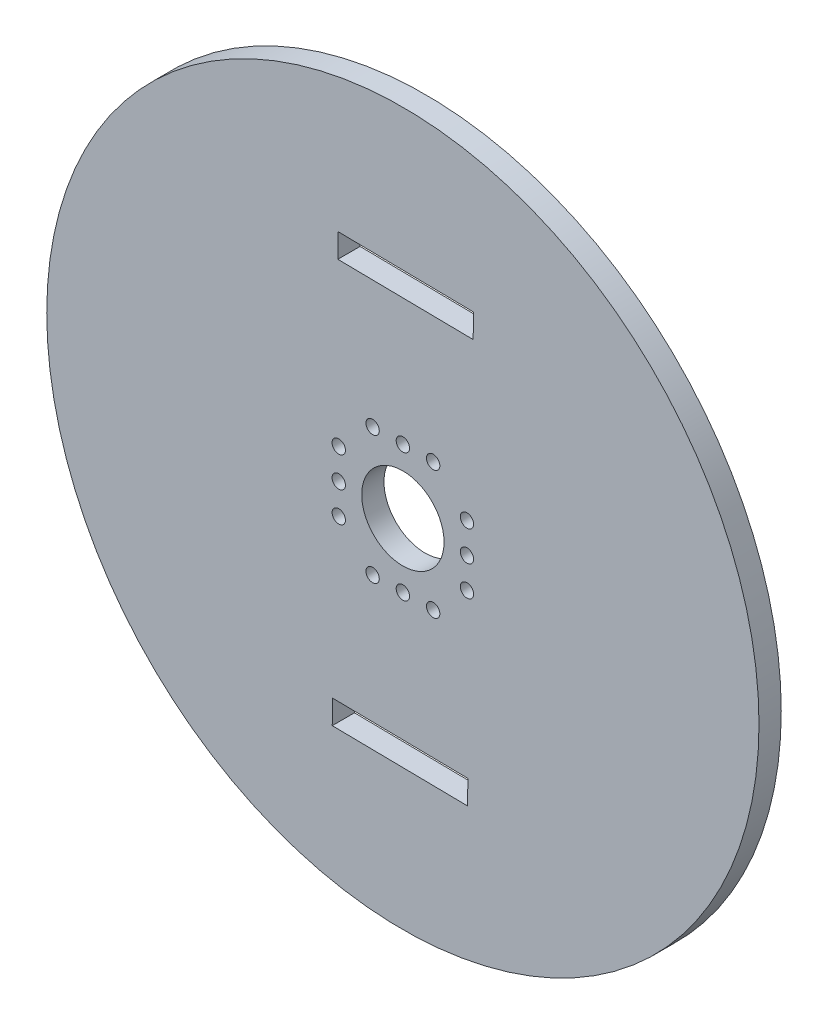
ISO-10303-21;
HEADER;
FILE_DESCRIPTION(('STEP AP214'),'2;1');
FILE_NAME('part.step','',(''),(''),'','','');
FILE_SCHEMA(('AUTOMOTIVE_DESIGN { 1 0 10303 214 1 1 1 1 }'));
ENDSEC;
DATA;
#1=APPLICATION_CONTEXT('core data for automotive mechanical design processes');
#2=APPLICATION_PROTOCOL_DEFINITION('international standard','automotive_design',2000,#1);
#3=PRODUCT_CONTEXT('',#1,'mechanical');
#4=PRODUCT('Part','Part','',(#3));
#5=PRODUCT_RELATED_PRODUCT_CATEGORY('part','',(#4));
#6=PRODUCT_DEFINITION_FORMATION('','',#4);
#7=PRODUCT_DEFINITION_CONTEXT('part definition',#1,'design');
#8=PRODUCT_DEFINITION('design','',#6,#7);
#9=PRODUCT_DEFINITION_SHAPE('','',#8);
#10=(LENGTH_UNIT() NAMED_UNIT(*) SI_UNIT(.MILLI.,.METRE.));
#11=(NAMED_UNIT(*) PLANE_ANGLE_UNIT() SI_UNIT($,.RADIAN.));
#12=(NAMED_UNIT(*) SI_UNIT($,.STERADIAN.) SOLID_ANGLE_UNIT());
#13=UNCERTAINTY_MEASURE_WITH_UNIT(LENGTH_MEASURE(1.E-05),#10,'distance_accuracy_value','');
#14=(GEOMETRIC_REPRESENTATION_CONTEXT(3) GLOBAL_UNCERTAINTY_ASSIGNED_CONTEXT((#13)) GLOBAL_UNIT_ASSIGNED_CONTEXT((#10,
#11,#12)) REPRESENTATION_CONTEXT('',''));
#15=CARTESIAN_POINT('',(0.,0.,0.));
#16=DIRECTION('',(0.,0.,1.));
#17=DIRECTION('',(1.,0.,0.));
#18=AXIS2_PLACEMENT_3D('',#15,#16,#17);
#19=CARTESIAN_POINT('',(3.39999999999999,7.19999999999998,2.5));
#20=DIRECTION('',(0.,0.,-1.));
#21=DIRECTION('',(-1.,0.,0.));
#22=AXIS2_PLACEMENT_3D('',#19,#20,#21);
#23=CYLINDRICAL_SURFACE('',#22,0.750000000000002);
#24=CARTESIAN_POINT('',(3.39999999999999,7.19999999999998,2.5));
#25=DIRECTION('',(0.,0.,1.));
#26=DIRECTION('',(1.,0.,0.));
#27=AXIS2_PLACEMENT_3D('',#24,#25,#26);
#28=CIRCLE('',#27,0.750000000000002);
#29=CARTESIAN_POINT('',(4.14999999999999,7.19999999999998,2.5));
#30=VERTEX_POINT('',#29);
#31=EDGE_CURVE('E48',#30,#30,#28,.T.);
#32=ORIENTED_EDGE('',*,*,#31,.T.);
#33=EDGE_LOOP('',(#32));
#34=FACE_BOUND('',#33,.T.);
#35=CARTESIAN_POINT('',(3.39999999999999,7.19999999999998,0.));
#36=DIRECTION('',(0.,0.,1.));
#37=DIRECTION('',(1.,0.,0.));
#38=AXIS2_PLACEMENT_3D('',#35,#36,#37);
#39=CIRCLE('',#38,0.750000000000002);
#40=CARTESIAN_POINT('',(4.14999999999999,7.19999999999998,0.));
#41=VERTEX_POINT('',#40);
#42=EDGE_CURVE('E243',#41,#41,#39,.T.);
#43=ORIENTED_EDGE('',*,*,#42,.F.);
#44=EDGE_LOOP('',(#43));
#45=FACE_BOUND('',#44,.T.);
#46=ADVANCED_FACE('F39',(#34,#45),#23,.F.);
#47=CARTESIAN_POINT('',(0.,7.19999999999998,2.5));
#48=DIRECTION('',(0.,0.,-1.));
#49=DIRECTION('',(-1.,0.,0.));
#50=AXIS2_PLACEMENT_3D('',#47,#48,#49);
#51=CYLINDRICAL_SURFACE('',#50,0.750000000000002);
#52=CARTESIAN_POINT('',(0.,7.19999999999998,2.5));
#53=DIRECTION('',(0.,0.,1.));
#54=DIRECTION('',(1.,0.,0.));
#55=AXIS2_PLACEMENT_3D('',#52,#53,#54);
#56=CIRCLE('',#55,0.750000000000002);
#57=CARTESIAN_POINT('',(0.749999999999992,7.19999999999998,2.5));
#58=VERTEX_POINT('',#57);
#59=EDGE_CURVE('E204',#58,#58,#56,.T.);
#60=ORIENTED_EDGE('',*,*,#59,.T.);
#61=EDGE_LOOP('',(#60));
#62=FACE_BOUND('',#61,.T.);
#63=CARTESIAN_POINT('',(0.,7.19999999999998,0.));
#64=DIRECTION('',(0.,0.,1.));
#65=DIRECTION('',(1.,0.,0.));
#66=AXIS2_PLACEMENT_3D('',#63,#64,#65);
#67=CIRCLE('',#66,0.750000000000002);
#68=CARTESIAN_POINT('',(0.749999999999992,7.19999999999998,0.));
#69=VERTEX_POINT('',#68);
#70=EDGE_CURVE('E241',#69,#69,#67,.T.);
#71=ORIENTED_EDGE('',*,*,#70,.F.);
#72=EDGE_LOOP('',(#71));
#73=FACE_BOUND('',#72,.T.);
#74=ADVANCED_FACE('F267',(#62,#73),#51,.F.);
#75=CARTESIAN_POINT('',(-3.40000000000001,7.19999999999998,2.5));
#76=DIRECTION('',(0.,0.,-1.));
#77=DIRECTION('',(-1.,0.,0.));
#78=AXIS2_PLACEMENT_3D('',#75,#76,#77);
#79=CYLINDRICAL_SURFACE('',#78,0.750000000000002);
#80=CARTESIAN_POINT('',(-3.40000000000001,7.19999999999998,2.5));
#81=DIRECTION('',(0.,0.,1.));
#82=DIRECTION('',(1.,0.,0.));
#83=AXIS2_PLACEMENT_3D('',#80,#81,#82);
#84=CIRCLE('',#83,0.750000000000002);
#85=CARTESIAN_POINT('',(-2.65000000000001,7.19999999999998,2.5));
#86=VERTEX_POINT('',#85);
#87=EDGE_CURVE('E201',#86,#86,#84,.T.);
#88=ORIENTED_EDGE('',*,*,#87,.T.);
#89=EDGE_LOOP('',(#88));
#90=FACE_BOUND('',#89,.T.);
#91=CARTESIAN_POINT('',(-3.40000000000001,7.19999999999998,0.));
#92=DIRECTION('',(0.,0.,1.));
#93=DIRECTION('',(1.,0.,0.));
#94=AXIS2_PLACEMENT_3D('',#91,#92,#93);
#95=CIRCLE('',#94,0.750000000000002);
#96=CARTESIAN_POINT('',(-2.65000000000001,7.19999999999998,0.));
#97=VERTEX_POINT('',#96);
#98=EDGE_CURVE('E238',#97,#97,#95,.T.);
#99=ORIENTED_EDGE('',*,*,#98,.F.);
#100=EDGE_LOOP('',(#99));
#101=FACE_BOUND('',#100,.T.);
#102=ADVANCED_FACE('F272',(#90,#101),#79,.F.);
#103=CARTESIAN_POINT('',(-7.20000000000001,3.39999999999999,2.5));
#104=DIRECTION('',(0.,0.,-1.));
#105=DIRECTION('',(-1.,0.,0.));
#106=AXIS2_PLACEMENT_3D('',#103,#104,#105);
#107=CYLINDRICAL_SURFACE('',#106,0.75);
#108=CARTESIAN_POINT('',(-7.20000000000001,3.39999999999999,2.5));
#109=DIRECTION('',(0.,0.,1.));
#110=DIRECTION('',(1.,0.,0.));
#111=AXIS2_PLACEMENT_3D('',#108,#109,#110);
#112=CIRCLE('',#111,0.75);
#113=CARTESIAN_POINT('',(-6.45000000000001,3.39999999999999,2.5));
#114=VERTEX_POINT('',#113);
#115=EDGE_CURVE('E198',#114,#114,#112,.T.);
#116=ORIENTED_EDGE('',*,*,#115,.T.);
#117=EDGE_LOOP('',(#116));
#118=FACE_BOUND('',#117,.T.);
#119=CARTESIAN_POINT('',(-7.20000000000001,3.39999999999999,0.));
#120=DIRECTION('',(0.,0.,1.));
#121=DIRECTION('',(1.,0.,0.));
#122=AXIS2_PLACEMENT_3D('',#119,#120,#121);
#123=CIRCLE('',#122,0.75);
#124=CARTESIAN_POINT('',(-6.45000000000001,3.39999999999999,0.));
#125=VERTEX_POINT('',#124);
#126=EDGE_CURVE('E235',#125,#125,#123,.T.);
#127=ORIENTED_EDGE('',*,*,#126,.F.);
#128=EDGE_LOOP('',(#127));
#129=FACE_BOUND('',#128,.T.);
#130=ADVANCED_FACE('F279',(#118,#129),#107,.F.);
#131=CARTESIAN_POINT('',(-7.20000000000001,0.,2.5));
#132=DIRECTION('',(0.,0.,-1.));
#133=DIRECTION('',(-1.,0.,0.));
#134=AXIS2_PLACEMENT_3D('',#131,#132,#133);
#135=CYLINDRICAL_SURFACE('',#134,0.75);
#136=CARTESIAN_POINT('',(-7.20000000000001,0.,2.5));
#137=DIRECTION('',(0.,0.,1.));
#138=DIRECTION('',(1.,0.,0.));
#139=AXIS2_PLACEMENT_3D('',#136,#137,#138);
#140=CIRCLE('',#139,0.75);
#141=CARTESIAN_POINT('',(-6.45000000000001,0.,2.5));
#142=VERTEX_POINT('',#141);
#143=EDGE_CURVE('E195',#142,#142,#140,.T.);
#144=ORIENTED_EDGE('',*,*,#143,.T.);
#145=EDGE_LOOP('',(#144));
#146=FACE_BOUND('',#145,.T.);
#147=CARTESIAN_POINT('',(-7.20000000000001,0.,0.));
#148=DIRECTION('',(0.,0.,1.));
#149=DIRECTION('',(1.,0.,0.));
#150=AXIS2_PLACEMENT_3D('',#147,#148,#149);
#151=CIRCLE('',#150,0.75);
#152=CARTESIAN_POINT('',(-6.45000000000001,0.,0.));
#153=VERTEX_POINT('',#152);
#154=EDGE_CURVE('E232',#153,#153,#151,.T.);
#155=ORIENTED_EDGE('',*,*,#154,.F.);
#156=EDGE_LOOP('',(#155));
#157=FACE_BOUND('',#156,.T.);
#158=ADVANCED_FACE('F283',(#146,#157),#135,.F.);
#159=CARTESIAN_POINT('',(-7.20000000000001,-3.40000000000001,2.5));
#160=DIRECTION('',(0.,0.,-1.));
#161=DIRECTION('',(-1.,0.,0.));
#162=AXIS2_PLACEMENT_3D('',#159,#160,#161);
#163=CYLINDRICAL_SURFACE('',#162,0.750000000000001);
#164=CARTESIAN_POINT('',(-7.20000000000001,-3.40000000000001,2.5));
#165=DIRECTION('',(0.,0.,1.));
#166=DIRECTION('',(1.,0.,0.));
#167=AXIS2_PLACEMENT_3D('',#164,#165,#166);
#168=CIRCLE('',#167,0.750000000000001);
#169=CARTESIAN_POINT('',(-6.45000000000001,-3.40000000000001,2.5));
#170=VERTEX_POINT('',#169);
#171=EDGE_CURVE('E192',#170,#170,#168,.T.);
#172=ORIENTED_EDGE('',*,*,#171,.T.);
#173=EDGE_LOOP('',(#172));
#174=FACE_BOUND('',#173,.T.);
#175=CARTESIAN_POINT('',(-7.20000000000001,-3.40000000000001,0.));
#176=DIRECTION('',(0.,0.,1.));
#177=DIRECTION('',(1.,0.,0.));
#178=AXIS2_PLACEMENT_3D('',#175,#176,#177);
#179=CIRCLE('',#178,0.750000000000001);
#180=CARTESIAN_POINT('',(-6.45000000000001,-3.40000000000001,0.));
#181=VERTEX_POINT('',#180);
#182=EDGE_CURVE('E229',#181,#181,#179,.T.);
#183=ORIENTED_EDGE('',*,*,#182,.F.);
#184=EDGE_LOOP('',(#183));
#185=FACE_BOUND('',#184,.T.);
#186=ADVANCED_FACE('F287',(#174,#185),#163,.F.);
#187=CARTESIAN_POINT('',(0.,-7.20000000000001,2.5));
#188=DIRECTION('',(0.,0.,-1.));
#189=DIRECTION('',(-1.,0.,0.));
#190=AXIS2_PLACEMENT_3D('',#187,#188,#189);
#191=CYLINDRICAL_SURFACE('',#190,0.75);
#192=CARTESIAN_POINT('',(0.,-7.20000000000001,2.5));
#193=DIRECTION('',(0.,0.,1.));
#194=DIRECTION('',(1.,0.,0.));
#195=AXIS2_PLACEMENT_3D('',#192,#193,#194);
#196=CIRCLE('',#195,0.75);
#197=CARTESIAN_POINT('',(0.749999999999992,-7.20000000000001,2.5));
#198=VERTEX_POINT('',#197);
#199=EDGE_CURVE('E189',#198,#198,#196,.T.);
#200=ORIENTED_EDGE('',*,*,#199,.T.);
#201=EDGE_LOOP('',(#200));
#202=FACE_BOUND('',#201,.T.);
#203=CARTESIAN_POINT('',(0.,-7.20000000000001,0.));
#204=DIRECTION('',(0.,0.,1.));
#205=DIRECTION('',(1.,0.,0.));
#206=AXIS2_PLACEMENT_3D('',#203,#204,#205);
#207=CIRCLE('',#206,0.75);
#208=CARTESIAN_POINT('',(0.749999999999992,-7.20000000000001,0.));
#209=VERTEX_POINT('',#208);
#210=EDGE_CURVE('E226',#209,#209,#207,.T.);
#211=ORIENTED_EDGE('',*,*,#210,.F.);
#212=EDGE_LOOP('',(#211));
#213=FACE_BOUND('',#212,.T.);
#214=ADVANCED_FACE('F291',(#202,#213),#191,.F.);
#215=CARTESIAN_POINT('',(-3.40000000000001,-7.20000000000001,2.5));
#216=DIRECTION('',(0.,0.,-1.));
#217=DIRECTION('',(-1.,0.,0.));
#218=AXIS2_PLACEMENT_3D('',#215,#216,#217);
#219=CYLINDRICAL_SURFACE('',#218,0.749999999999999);
#220=CARTESIAN_POINT('',(-3.40000000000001,-7.20000000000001,2.5));
#221=DIRECTION('',(0.,0.,1.));
#222=DIRECTION('',(1.,0.,0.));
#223=AXIS2_PLACEMENT_3D('',#220,#221,#222);
#224=CIRCLE('',#223,0.749999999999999);
#225=CARTESIAN_POINT('',(-2.65000000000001,-7.20000000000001,2.5));
#226=VERTEX_POINT('',#225);
#227=EDGE_CURVE('E186',#226,#226,#224,.T.);
#228=ORIENTED_EDGE('',*,*,#227,.T.);
#229=EDGE_LOOP('',(#228));
#230=FACE_BOUND('',#229,.T.);
#231=CARTESIAN_POINT('',(-3.40000000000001,-7.20000000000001,0.));
#232=DIRECTION('',(0.,0.,1.));
#233=DIRECTION('',(1.,0.,0.));
#234=AXIS2_PLACEMENT_3D('',#231,#232,#233);
#235=CIRCLE('',#234,0.749999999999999);
#236=CARTESIAN_POINT('',(-2.65000000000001,-7.20000000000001,0.));
#237=VERTEX_POINT('',#236);
#238=EDGE_CURVE('E223',#237,#237,#235,.T.);
#239=ORIENTED_EDGE('',*,*,#238,.F.);
#240=EDGE_LOOP('',(#239));
#241=FACE_BOUND('',#240,.T.);
#242=ADVANCED_FACE('F295',(#230,#241),#219,.F.);
#243=CARTESIAN_POINT('',(3.39999999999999,-7.20000000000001,2.5));
#244=DIRECTION('',(0.,0.,-1.));
#245=DIRECTION('',(-1.,0.,0.));
#246=AXIS2_PLACEMENT_3D('',#243,#244,#245);
#247=CYLINDRICAL_SURFACE('',#246,0.750000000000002);
#248=CARTESIAN_POINT('',(3.39999999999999,-7.20000000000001,2.5));
#249=DIRECTION('',(0.,0.,1.));
#250=DIRECTION('',(1.,0.,0.));
#251=AXIS2_PLACEMENT_3D('',#248,#249,#250);
#252=CIRCLE('',#251,0.750000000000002);
#253=CARTESIAN_POINT('',(4.14999999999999,-7.20000000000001,2.5));
#254=VERTEX_POINT('',#253);
#255=EDGE_CURVE('E183',#254,#254,#252,.T.);
#256=ORIENTED_EDGE('',*,*,#255,.T.);
#257=EDGE_LOOP('',(#256));
#258=FACE_BOUND('',#257,.T.);
#259=CARTESIAN_POINT('',(3.39999999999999,-7.20000000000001,0.));
#260=DIRECTION('',(0.,0.,1.));
#261=DIRECTION('',(1.,0.,0.));
#262=AXIS2_PLACEMENT_3D('',#259,#260,#261);
#263=CIRCLE('',#262,0.750000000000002);
#264=CARTESIAN_POINT('',(4.14999999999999,-7.20000000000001,0.));
#265=VERTEX_POINT('',#264);
#266=EDGE_CURVE('E220',#265,#265,#263,.T.);
#267=ORIENTED_EDGE('',*,*,#266,.F.);
#268=EDGE_LOOP('',(#267));
#269=FACE_BOUND('',#268,.T.);
#270=ADVANCED_FACE('F299',(#258,#269),#247,.F.);
#271=CARTESIAN_POINT('',(7.19999999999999,0.,2.5));
#272=DIRECTION('',(0.,0.,-1.));
#273=DIRECTION('',(-1.,0.,0.));
#274=AXIS2_PLACEMENT_3D('',#271,#272,#273);
#275=CYLINDRICAL_SURFACE('',#274,0.750000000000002);
#276=CARTESIAN_POINT('',(7.19999999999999,0.,2.5));
#277=DIRECTION('',(0.,0.,1.));
#278=DIRECTION('',(1.,0.,0.));
#279=AXIS2_PLACEMENT_3D('',#276,#277,#278);
#280=CIRCLE('',#279,0.750000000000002);
#281=CARTESIAN_POINT('',(7.94999999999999,0.,2.5));
#282=VERTEX_POINT('',#281);
#283=EDGE_CURVE('E180',#282,#282,#280,.T.);
#284=ORIENTED_EDGE('',*,*,#283,.T.);
#285=EDGE_LOOP('',(#284));
#286=FACE_BOUND('',#285,.T.);
#287=CARTESIAN_POINT('',(7.19999999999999,0.,0.));
#288=DIRECTION('',(0.,0.,1.));
#289=DIRECTION('',(1.,0.,0.));
#290=AXIS2_PLACEMENT_3D('',#287,#288,#289);
#291=CIRCLE('',#290,0.750000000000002);
#292=CARTESIAN_POINT('',(7.94999999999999,0.,0.));
#293=VERTEX_POINT('',#292);
#294=EDGE_CURVE('E217',#293,#293,#291,.T.);
#295=ORIENTED_EDGE('',*,*,#294,.F.);
#296=EDGE_LOOP('',(#295));
#297=FACE_BOUND('',#296,.T.);
#298=ADVANCED_FACE('F303',(#286,#297),#275,.F.);
#299=CARTESIAN_POINT('',(7.19999999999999,3.39999999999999,2.5));
#300=DIRECTION('',(0.,0.,-1.));
#301=DIRECTION('',(-1.,0.,0.));
#302=AXIS2_PLACEMENT_3D('',#299,#300,#301);
#303=CYLINDRICAL_SURFACE('',#302,0.750000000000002);
#304=CARTESIAN_POINT('',(7.19999999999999,3.39999999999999,2.5));
#305=DIRECTION('',(0.,0.,1.));
#306=DIRECTION('',(1.,0.,0.));
#307=AXIS2_PLACEMENT_3D('',#304,#305,#306);
#308=CIRCLE('',#307,0.750000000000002);
#309=CARTESIAN_POINT('',(7.94999999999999,3.39999999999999,2.5));
#310=VERTEX_POINT('',#309);
#311=EDGE_CURVE('E177',#310,#310,#308,.T.);
#312=ORIENTED_EDGE('',*,*,#311,.T.);
#313=EDGE_LOOP('',(#312));
#314=FACE_BOUND('',#313,.T.);
#315=CARTESIAN_POINT('',(7.19999999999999,3.39999999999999,0.));
#316=DIRECTION('',(0.,0.,1.));
#317=DIRECTION('',(1.,0.,0.));
#318=AXIS2_PLACEMENT_3D('',#315,#316,#317);
#319=CIRCLE('',#318,0.750000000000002);
#320=CARTESIAN_POINT('',(7.94999999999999,3.39999999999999,0.));
#321=VERTEX_POINT('',#320);
#322=EDGE_CURVE('E214',#321,#321,#319,.T.);
#323=ORIENTED_EDGE('',*,*,#322,.F.);
#324=EDGE_LOOP('',(#323));
#325=FACE_BOUND('',#324,.T.);
#326=ADVANCED_FACE('F307',(#314,#325),#303,.F.);
#327=CARTESIAN_POINT('',(7.19999999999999,-3.40000000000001,2.5));
#328=DIRECTION('',(0.,0.,-1.));
#329=DIRECTION('',(-1.,0.,0.));
#330=AXIS2_PLACEMENT_3D('',#327,#328,#329);
#331=CYLINDRICAL_SURFACE('',#330,0.750000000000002);
#332=CARTESIAN_POINT('',(7.19999999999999,-3.40000000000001,2.5));
#333=DIRECTION('',(0.,0.,1.));
#334=DIRECTION('',(1.,0.,0.));
#335=AXIS2_PLACEMENT_3D('',#332,#333,#334);
#336=CIRCLE('',#335,0.750000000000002);
#337=CARTESIAN_POINT('',(7.94999999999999,-3.40000000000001,2.5));
#338=VERTEX_POINT('',#337);
#339=EDGE_CURVE('E174',#338,#338,#336,.T.);
#340=ORIENTED_EDGE('',*,*,#339,.T.);
#341=EDGE_LOOP('',(#340));
#342=FACE_BOUND('',#341,.T.);
#343=CARTESIAN_POINT('',(7.19999999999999,-3.40000000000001,0.));
#344=DIRECTION('',(0.,0.,1.));
#345=DIRECTION('',(1.,0.,0.));
#346=AXIS2_PLACEMENT_3D('',#343,#344,#345);
#347=CIRCLE('',#346,0.750000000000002);
#348=CARTESIAN_POINT('',(7.94999999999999,-3.40000000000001,0.));
#349=VERTEX_POINT('',#348);
#350=EDGE_CURVE('E211',#349,#349,#347,.T.);
#351=ORIENTED_EDGE('',*,*,#350,.F.);
#352=EDGE_LOOP('',(#351));
#353=FACE_BOUND('',#352,.T.);
#354=ADVANCED_FACE('F262',(#342,#353),#331,.F.);
#355=CARTESIAN_POINT('',(0.,0.,2.5));
#356=DIRECTION('',(0.,0.,-1.));
#357=DIRECTION('',(-1.,0.,0.));
#358=AXIS2_PLACEMENT_3D('',#355,#356,#357);
#359=CYLINDRICAL_SURFACE('',#358,40.);
#360=CARTESIAN_POINT('',(0.,0.,2.5));
#361=DIRECTION('',(0.,0.,1.));
#362=DIRECTION('',(1.,0.,0.));
#363=AXIS2_PLACEMENT_3D('',#360,#361,#362);
#364=CIRCLE('',#363,40.);
#365=CARTESIAN_POINT('',(40.,0.,2.5));
#366=VERTEX_POINT('',#365);
#367=EDGE_CURVE('E171',#366,#366,#364,.T.);
#368=ORIENTED_EDGE('',*,*,#367,.F.);
#369=EDGE_LOOP('',(#368));
#370=FACE_BOUND('',#369,.T.);
#371=CARTESIAN_POINT('',(0.,0.,0.));
#372=DIRECTION('',(0.,0.,1.));
#373=DIRECTION('',(1.,0.,0.));
#374=AXIS2_PLACEMENT_3D('',#371,#372,#373);
#375=CIRCLE('',#374,40.);
#376=CARTESIAN_POINT('',(40.,0.,0.));
#377=VERTEX_POINT('',#376);
#378=EDGE_CURVE('E170',#377,#377,#375,.T.);
#379=ORIENTED_EDGE('',*,*,#378,.T.);
#380=EDGE_LOOP('',(#379));
#381=FACE_BOUND('',#380,.T.);
#382=ADVANCED_FACE('F41',(#370,#381),#359,.T.);
#383=CARTESIAN_POINT('',(0.,0.,2.5));
#384=DIRECTION('',(0.,0.,-1.));
#385=DIRECTION('',(-1.,0.,0.));
#386=AXIS2_PLACEMENT_3D('',#383,#384,#385);
#387=CYLINDRICAL_SURFACE('',#386,4.625);
#388=CARTESIAN_POINT('',(0.,0.,2.5));
#389=DIRECTION('',(0.,0.,1.));
#390=DIRECTION('',(1.,0.,0.));
#391=AXIS2_PLACEMENT_3D('',#388,#389,#390);
#392=CIRCLE('',#391,4.625);
#393=CARTESIAN_POINT('',(4.62499999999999,0.,2.5));
#394=VERTEX_POINT('',#393);
#395=EDGE_CURVE('E11',#394,#394,#392,.T.);
#396=ORIENTED_EDGE('',*,*,#395,.T.);
#397=EDGE_LOOP('',(#396));
#398=FACE_BOUND('',#397,.T.);
#399=CARTESIAN_POINT('',(0.,0.,0.));
#400=DIRECTION('',(0.,0.,1.));
#401=DIRECTION('',(1.,0.,0.));
#402=AXIS2_PLACEMENT_3D('',#399,#400,#401);
#403=CIRCLE('',#402,4.625);
#404=CARTESIAN_POINT('',(4.62499999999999,0.,0.));
#405=VERTEX_POINT('',#404);
#406=EDGE_CURVE('E43',#405,#405,#403,.T.);
#407=ORIENTED_EDGE('',*,*,#406,.F.);
#408=EDGE_LOOP('',(#407));
#409=FACE_BOUND('',#408,.T.);
#410=ADVANCED_FACE('F251',(#398,#409),#387,.F.);
#411=CARTESIAN_POINT('',(0.,0.,2.5));
#412=DIRECTION('',(0.,0.,1.));
#413=DIRECTION('',(1.,0.,0.));
#414=AXIS2_PLACEMENT_3D('',#411,#412,#413);
#415=PLANE('',#414);
#416=DIRECTION('',(-0.0138248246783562,-0.999904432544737,0.));
#417=VECTOR('',#416,1.);
#418=CARTESIAN_POINT('',(-7.59927368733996,0.105068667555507,2.5));
#419=LINE('',#418,#417);
#420=CARTESIAN_POINT('',(-7.26537339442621,24.2549867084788,2.5));
#421=VERTEX_POINT('',#420);
#422=CARTESIAN_POINT('',(-7.30270042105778,21.5552447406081,2.5));
#423=VERTEX_POINT('',#422);
#424=EDGE_CURVE('E168',#421,#423,#419,.T.);
#425=ORIENTED_EDGE('',*,*,#424,.F.);
#426=DIRECTION('',(-0.999904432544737,0.0138248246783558,0.));
#427=VECTOR('',#426,1.);
#428=CARTESIAN_POINT('',(0.333900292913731,24.1499180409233,2.5));
#429=LINE('',#428,#427);
#430=CARTESIAN_POINT('',(7.93317398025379,24.0448493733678,2.5));
#431=VERTEX_POINT('',#430);
#432=EDGE_CURVE('E163',#431,#421,#429,.T.);
#433=ORIENTED_EDGE('',*,*,#432,.F.);
#434=DIRECTION('',(0.0138248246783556,0.999904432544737,0.));
#435=VECTOR('',#434,1.);
#436=CARTESIAN_POINT('',(7.59927368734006,-0.105068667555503,2.5));
#437=LINE('',#436,#435);
#438=CARTESIAN_POINT('',(7.89584695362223,21.345107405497,2.5));
#439=VERTEX_POINT('',#438);
#440=EDGE_CURVE('E111',#439,#431,#437,.T.);
#441=ORIENTED_EDGE('',*,*,#440,.F.);
#442=DIRECTION('',(0.999904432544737,-0.013824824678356,0.));
#443=VECTOR('',#442,1.);
#444=CARTESIAN_POINT('',(0.296573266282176,21.4501760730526,2.5));
#445=LINE('',#444,#443);
#446=EDGE_CURVE('E166',#423,#439,#445,.T.);
#447=ORIENTED_EDGE('',*,*,#446,.F.);
#448=EDGE_LOOP('',(#425,#433,#441,#447));
#449=FACE_BOUND('',#448,.T.);
#450=DIRECTION('',(0.0138248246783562,0.999904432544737,0.));
#451=VECTOR('',#450,1.);
#452=CARTESIAN_POINT('',(7.59927368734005,-0.105068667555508,2.5));
#453=LINE('',#452,#451);
#454=CARTESIAN_POINT('',(7.26428389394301,-24.3337867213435,2.5));
#455=VERTEX_POINT('',#454);
#456=CARTESIAN_POINT('',(7.30161092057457,-21.6340447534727,2.5));
#457=VERTEX_POINT('',#456);
#458=EDGE_CURVE('E161',#455,#457,#453,.T.);
#459=ORIENTED_EDGE('',*,*,#458,.F.);
#460=DIRECTION('',(0.999904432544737,-0.0138248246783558,0.));
#461=VECTOR('',#460,1.);
#462=CARTESIAN_POINT('',(-0.334989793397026,-24.228718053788,2.5));
#463=LINE('',#462,#461);
#464=CARTESIAN_POINT('',(-7.934263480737,-24.1236493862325,2.5));
#465=VERTEX_POINT('',#464);
#466=EDGE_CURVE('E135',#465,#455,#463,.T.);
#467=ORIENTED_EDGE('',*,*,#466,.F.);
#468=DIRECTION('',(-0.0138248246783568,-0.999904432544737,0.));
#469=VECTOR('',#468,1.);
#470=CARTESIAN_POINT('',(-7.59927368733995,0.105068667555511,2.5));
#471=LINE('',#470,#469);
#472=CARTESIAN_POINT('',(-7.89693645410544,-21.4239074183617,2.5));
#473=VERTEX_POINT('',#472);
#474=EDGE_CURVE('E157',#473,#465,#471,.T.);
#475=ORIENTED_EDGE('',*,*,#474,.F.);
#476=DIRECTION('',(-0.999904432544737,0.0138248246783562,0.));
#477=VECTOR('',#476,1.);
#478=CARTESIAN_POINT('',(-0.297662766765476,-21.5289760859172,2.5));
#479=LINE('',#478,#477);
#480=EDGE_CURVE('E159',#457,#473,#479,.T.);
#481=ORIENTED_EDGE('',*,*,#480,.F.);
#482=EDGE_LOOP('',(#459,#467,#475,#481));
#483=FACE_BOUND('',#482,.T.);
#484=ORIENTED_EDGE('',*,*,#367,.T.);
#485=EDGE_LOOP('',(#484));
#486=FACE_BOUND('',#485,.T.);
#487=ORIENTED_EDGE('',*,*,#339,.F.);
#488=EDGE_LOOP('',(#487));
#489=FACE_BOUND('',#488,.T.);
#490=ORIENTED_EDGE('',*,*,#311,.F.);
#491=EDGE_LOOP('',(#490));
#492=FACE_BOUND('',#491,.T.);
#493=ORIENTED_EDGE('',*,*,#283,.F.);
#494=EDGE_LOOP('',(#493));
#495=FACE_BOUND('',#494,.T.);
#496=ORIENTED_EDGE('',*,*,#255,.F.);
#497=EDGE_LOOP('',(#496));
#498=FACE_BOUND('',#497,.T.);
#499=ORIENTED_EDGE('',*,*,#227,.F.);
#500=EDGE_LOOP('',(#499));
#501=FACE_BOUND('',#500,.T.);
#502=ORIENTED_EDGE('',*,*,#199,.F.);
#503=EDGE_LOOP('',(#502));
#504=FACE_BOUND('',#503,.T.);
#505=ORIENTED_EDGE('',*,*,#171,.F.);
#506=EDGE_LOOP('',(#505));
#507=FACE_BOUND('',#506,.T.);
#508=ORIENTED_EDGE('',*,*,#143,.F.);
#509=EDGE_LOOP('',(#508));
#510=FACE_BOUND('',#509,.T.);
#511=ORIENTED_EDGE('',*,*,#115,.F.);
#512=EDGE_LOOP('',(#511));
#513=FACE_BOUND('',#512,.T.);
#514=ORIENTED_EDGE('',*,*,#87,.F.);
#515=EDGE_LOOP('',(#514));
#516=FACE_BOUND('',#515,.T.);
#517=ORIENTED_EDGE('',*,*,#59,.F.);
#518=EDGE_LOOP('',(#517));
#519=FACE_BOUND('',#518,.T.);
#520=ORIENTED_EDGE('',*,*,#31,.F.);
#521=EDGE_LOOP('',(#520));
#522=FACE_BOUND('',#521,.T.);
#523=ORIENTED_EDGE('',*,*,#395,.F.);
#524=EDGE_LOOP('',(#523));
#525=FACE_BOUND('',#524,.T.);
#526=ADVANCED_FACE('F253',(#449,#483,#486,#489,#492,#495,#498,#501,#504,#507,#510,#513,#516,
#519,#522,#525),#415,.T.);
#527=CARTESIAN_POINT('',(0.,0.,0.));
#528=DIRECTION('',(0.,0.,1.));
#529=DIRECTION('',(1.,0.,0.));
#530=AXIS2_PLACEMENT_3D('',#527,#528,#529);
#531=PLANE('',#530);
#532=DIRECTION('',(0.999904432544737,-0.0138248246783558,0.));
#533=VECTOR('',#532,1.);
#534=CARTESIAN_POINT('',(-7.26537339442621,24.2549867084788,0.));
#535=LINE('',#534,#533);
#536=CARTESIAN_POINT('',(-7.26537339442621,24.2549867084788,0.));
#537=VERTEX_POINT('',#536);
#538=CARTESIAN_POINT('',(7.93317398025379,24.0448493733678,0.));
#539=VERTEX_POINT('',#538);
#540=EDGE_CURVE('E118',#537,#539,#535,.T.);
#541=ORIENTED_EDGE('',*,*,#540,.F.);
#542=DIRECTION('',(0.0138248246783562,0.999904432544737,0.));
#543=VECTOR('',#542,1.);
#544=CARTESIAN_POINT('',(-7.30270042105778,21.5552447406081,0.));
#545=LINE('',#544,#543);
#546=CARTESIAN_POINT('',(-7.30270042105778,21.5552447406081,0.));
#547=VERTEX_POINT('',#546);
#548=EDGE_CURVE('E123',#547,#537,#545,.T.);
#549=ORIENTED_EDGE('',*,*,#548,.F.);
#550=DIRECTION('',(-0.999904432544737,0.013824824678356,0.));
#551=VECTOR('',#550,1.);
#552=CARTESIAN_POINT('',(7.89584695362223,21.345107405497,0.));
#553=LINE('',#552,#551);
#554=CARTESIAN_POINT('',(7.89584695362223,21.345107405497,0.));
#555=VERTEX_POINT('',#554);
#556=EDGE_CURVE('E128',#555,#547,#553,.T.);
#557=ORIENTED_EDGE('',*,*,#556,.F.);
#558=DIRECTION('',(-0.0138248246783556,-0.999904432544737,0.));
#559=VECTOR('',#558,1.);
#560=CARTESIAN_POINT('',(7.93317398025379,24.0448493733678,0.));
#561=LINE('',#560,#559);
#562=EDGE_CURVE('E108',#539,#555,#561,.T.);
#563=ORIENTED_EDGE('',*,*,#562,.F.);
#564=EDGE_LOOP('',(#541,#549,#557,#563));
#565=FACE_BOUND('',#564,.T.);
#566=DIRECTION('',(-0.999904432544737,0.0138248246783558,0.));
#567=VECTOR('',#566,1.);
#568=CARTESIAN_POINT('',(7.26428389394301,-24.3337867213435,0.));
#569=LINE('',#568,#567);
#570=CARTESIAN_POINT('',(7.26428389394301,-24.3337867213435,0.));
#571=VERTEX_POINT('',#570);
#572=CARTESIAN_POINT('',(-7.934263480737,-24.1236493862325,0.));
#573=VERTEX_POINT('',#572);
#574=EDGE_CURVE('E152',#571,#573,#569,.T.);
#575=ORIENTED_EDGE('',*,*,#574,.F.);
#576=DIRECTION('',(-0.0138248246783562,-0.999904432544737,0.));
#577=VECTOR('',#576,1.);
#578=CARTESIAN_POINT('',(7.26428389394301,-24.3337867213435,0.));
#579=LINE('',#578,#577);
#580=CARTESIAN_POINT('',(7.30161092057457,-21.6340447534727,0.));
#581=VERTEX_POINT('',#580);
#582=EDGE_CURVE('E154',#581,#571,#579,.T.);
#583=ORIENTED_EDGE('',*,*,#582,.F.);
#584=DIRECTION('',(0.999904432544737,-0.0138248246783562,0.));
#585=VECTOR('',#584,1.);
#586=CARTESIAN_POINT('',(7.30161092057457,-21.6340447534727,0.));
#587=LINE('',#586,#585);
#588=CARTESIAN_POINT('',(-7.89693645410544,-21.4239074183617,0.));
#589=VERTEX_POINT('',#588);
#590=EDGE_CURVE('E141',#589,#581,#587,.T.);
#591=ORIENTED_EDGE('',*,*,#590,.F.);
#592=DIRECTION('',(0.0138248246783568,0.999904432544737,0.));
#593=VECTOR('',#592,1.);
#594=CARTESIAN_POINT('',(-7.934263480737,-24.1236493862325,0.));
#595=LINE('',#594,#593);
#596=EDGE_CURVE('E149',#573,#589,#595,.T.);
#597=ORIENTED_EDGE('',*,*,#596,.F.);
#598=EDGE_LOOP('',(#575,#583,#591,#597));
#599=FACE_BOUND('',#598,.T.);
#600=ORIENTED_EDGE('',*,*,#378,.F.);
#601=EDGE_LOOP('',(#600));
#602=FACE_BOUND('',#601,.T.);
#603=ORIENTED_EDGE('',*,*,#350,.T.);
#604=EDGE_LOOP('',(#603));
#605=FACE_BOUND('',#604,.T.);
#606=ORIENTED_EDGE('',*,*,#322,.T.);
#607=EDGE_LOOP('',(#606));
#608=FACE_BOUND('',#607,.T.);
#609=ORIENTED_EDGE('',*,*,#294,.T.);
#610=EDGE_LOOP('',(#609));
#611=FACE_BOUND('',#610,.T.);
#612=ORIENTED_EDGE('',*,*,#266,.T.);
#613=EDGE_LOOP('',(#612));
#614=FACE_BOUND('',#613,.T.);
#615=ORIENTED_EDGE('',*,*,#238,.T.);
#616=EDGE_LOOP('',(#615));
#617=FACE_BOUND('',#616,.T.);
#618=ORIENTED_EDGE('',*,*,#210,.T.);
#619=EDGE_LOOP('',(#618));
#620=FACE_BOUND('',#619,.T.);
#621=ORIENTED_EDGE('',*,*,#182,.T.);
#622=EDGE_LOOP('',(#621));
#623=FACE_BOUND('',#622,.T.);
#624=ORIENTED_EDGE('',*,*,#154,.T.);
#625=EDGE_LOOP('',(#624));
#626=FACE_BOUND('',#625,.T.);
#627=ORIENTED_EDGE('',*,*,#126,.T.);
#628=EDGE_LOOP('',(#627));
#629=FACE_BOUND('',#628,.T.);
#630=ORIENTED_EDGE('',*,*,#98,.T.);
#631=EDGE_LOOP('',(#630));
#632=FACE_BOUND('',#631,.T.);
#633=ORIENTED_EDGE('',*,*,#70,.T.);
#634=EDGE_LOOP('',(#633));
#635=FACE_BOUND('',#634,.T.);
#636=ORIENTED_EDGE('',*,*,#42,.T.);
#637=EDGE_LOOP('',(#636));
#638=FACE_BOUND('',#637,.T.);
#639=ORIENTED_EDGE('',*,*,#406,.T.);
#640=EDGE_LOOP('',(#639));
#641=FACE_BOUND('',#640,.T.);
#642=ADVANCED_FACE('F125',(#565,#599,#602,#605,#608,#611,#614,#617,#620,#623,#626,#629,#632,
#635,#638,#641),#531,.F.);
#643=CARTESIAN_POINT('',(7.26428389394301,-24.3337867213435,10.));
#644=DIRECTION('',(0.999904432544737,-0.0138248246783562,0.));
#645=DIRECTION('',(0.0138248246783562,0.999904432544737,0.));
#646=AXIS2_PLACEMENT_3D('',#643,#644,#645);
#647=PLANE('',#646);
#648=ORIENTED_EDGE('',*,*,#458,.T.);
#649=DIRECTION('',(0.,0.,-1.));
#650=VECTOR('',#649,1.);
#651=CARTESIAN_POINT('',(7.30161092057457,-21.6340447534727,10.));
#652=LINE('',#651,#650);
#653=EDGE_CURVE('E145',#457,#581,#652,.T.);
#654=ORIENTED_EDGE('',*,*,#653,.T.);
#655=ORIENTED_EDGE('',*,*,#582,.T.);
#656=DIRECTION('',(0.,0.,-1.));
#657=VECTOR('',#656,1.);
#658=CARTESIAN_POINT('',(7.26428389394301,-24.3337867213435,10.));
#659=LINE('',#658,#657);
#660=EDGE_CURVE('E138',#455,#571,#659,.T.);
#661=ORIENTED_EDGE('',*,*,#660,.F.);
#662=EDGE_LOOP('',(#648,#654,#655,#661));
#663=FACE_BOUND('',#662,.T.);
#664=ADVANCED_FACE('F321',(#663),#647,.F.);
#665=CARTESIAN_POINT('',(7.30161092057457,-21.6340447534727,10.));
#666=DIRECTION('',(0.0138248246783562,0.999904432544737,0.));
#667=DIRECTION('',(-0.999904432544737,0.0138248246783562,0.));
#668=AXIS2_PLACEMENT_3D('',#665,#666,#667);
#669=PLANE('',#668);
#670=ORIENTED_EDGE('',*,*,#480,.T.);
#671=DIRECTION('',(0.,0.,-1.));
#672=VECTOR('',#671,1.);
#673=CARTESIAN_POINT('',(-7.89693645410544,-21.4239074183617,10.));
#674=LINE('',#673,#672);
#675=EDGE_CURVE('E143',#473,#589,#674,.T.);
#676=ORIENTED_EDGE('',*,*,#675,.T.);
#677=ORIENTED_EDGE('',*,*,#590,.T.);
#678=ORIENTED_EDGE('',*,*,#653,.F.);
#679=EDGE_LOOP('',(#670,#676,#677,#678));
#680=FACE_BOUND('',#679,.T.);
#681=ADVANCED_FACE('F354',(#680),#669,.F.);
#682=CARTESIAN_POINT('',(-7.934263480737,-24.1236493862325,10.));
#683=DIRECTION('',(-0.999904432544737,0.0138248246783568,0.));
#684=DIRECTION('',(-0.0138248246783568,-0.999904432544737,0.));
#685=AXIS2_PLACEMENT_3D('',#682,#683,#684);
#686=PLANE('',#685);
#687=ORIENTED_EDGE('',*,*,#474,.T.);
#688=DIRECTION('',(0.,0.,-1.));
#689=VECTOR('',#688,1.);
#690=CARTESIAN_POINT('',(-7.934263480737,-24.1236493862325,10.));
#691=LINE('',#690,#689);
#692=EDGE_CURVE('E64',#465,#573,#691,.T.);
#693=ORIENTED_EDGE('',*,*,#692,.T.);
#694=ORIENTED_EDGE('',*,*,#596,.T.);
#695=ORIENTED_EDGE('',*,*,#675,.F.);
#696=EDGE_LOOP('',(#687,#693,#694,#695));
#697=FACE_BOUND('',#696,.T.);
#698=ADVANCED_FACE('F360',(#697),#686,.F.);
#699=CARTESIAN_POINT('',(7.26428389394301,-24.3337867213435,10.));
#700=DIRECTION('',(-0.0138248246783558,-0.999904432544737,0.));
#701=DIRECTION('',(0.999904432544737,-0.0138248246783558,0.));
#702=AXIS2_PLACEMENT_3D('',#699,#700,#701);
#703=PLANE('',#702);
#704=ORIENTED_EDGE('',*,*,#466,.T.);
#705=ORIENTED_EDGE('',*,*,#660,.T.);
#706=ORIENTED_EDGE('',*,*,#574,.T.);
#707=ORIENTED_EDGE('',*,*,#692,.F.);
#708=EDGE_LOOP('',(#704,#705,#706,#707));
#709=FACE_BOUND('',#708,.T.);
#710=ADVANCED_FACE('F364',(#709),#703,.F.);
#711=CARTESIAN_POINT('',(-7.30270042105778,21.5552447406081,10.));
#712=DIRECTION('',(-0.999904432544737,0.0138248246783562,0.));
#713=DIRECTION('',(-0.0138248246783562,-0.999904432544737,0.));
#714=AXIS2_PLACEMENT_3D('',#711,#712,#713);
#715=PLANE('',#714);
#716=ORIENTED_EDGE('',*,*,#424,.T.);
#717=DIRECTION('',(0.,0.,-1.));
#718=VECTOR('',#717,1.);
#719=CARTESIAN_POINT('',(-7.30270042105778,21.5552447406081,10.));
#720=LINE('',#719,#718);
#721=EDGE_CURVE('E133',#423,#547,#720,.T.);
#722=ORIENTED_EDGE('',*,*,#721,.T.);
#723=ORIENTED_EDGE('',*,*,#548,.T.);
#724=DIRECTION('',(0.,0.,-1.));
#725=VECTOR('',#724,1.);
#726=CARTESIAN_POINT('',(-7.26537339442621,24.2549867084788,10.));
#727=LINE('',#726,#725);
#728=EDGE_CURVE('E114',#421,#537,#727,.T.);
#729=ORIENTED_EDGE('',*,*,#728,.F.);
#730=EDGE_LOOP('',(#716,#722,#723,#729));
#731=FACE_BOUND('',#730,.T.);
#732=ADVANCED_FACE('F367',(#731),#715,.F.);
#733=CARTESIAN_POINT('',(7.89584695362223,21.345107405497,10.));
#734=DIRECTION('',(-0.013824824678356,-0.999904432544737,0.));
#735=DIRECTION('',(0.999904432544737,-0.013824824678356,0.));
#736=AXIS2_PLACEMENT_3D('',#733,#734,#735);
#737=PLANE('',#736);
#738=ORIENTED_EDGE('',*,*,#446,.T.);
#739=DIRECTION('',(0.,0.,-1.));
#740=VECTOR('',#739,1.);
#741=CARTESIAN_POINT('',(7.89584695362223,21.345107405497,10.));
#742=LINE('',#741,#740);
#743=EDGE_CURVE('E113',#439,#555,#742,.T.);
#744=ORIENTED_EDGE('',*,*,#743,.T.);
#745=ORIENTED_EDGE('',*,*,#556,.T.);
#746=ORIENTED_EDGE('',*,*,#721,.F.);
#747=EDGE_LOOP('',(#738,#744,#745,#746));
#748=FACE_BOUND('',#747,.T.);
#749=ADVANCED_FACE('F371',(#748),#737,.F.);
#750=CARTESIAN_POINT('',(7.93317398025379,24.0448493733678,10.));
#751=DIRECTION('',(0.999904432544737,-0.0138248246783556,0.));
#752=DIRECTION('',(0.0138248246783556,0.999904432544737,0.));
#753=AXIS2_PLACEMENT_3D('',#750,#751,#752);
#754=PLANE('',#753);
#755=ORIENTED_EDGE('',*,*,#440,.T.);
#756=DIRECTION('',(0.,0.,-1.));
#757=VECTOR('',#756,1.);
#758=CARTESIAN_POINT('',(7.93317398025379,24.0448493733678,10.));
#759=LINE('',#758,#757);
#760=EDGE_CURVE('E56',#431,#539,#759,.T.);
#761=ORIENTED_EDGE('',*,*,#760,.T.);
#762=ORIENTED_EDGE('',*,*,#562,.T.);
#763=ORIENTED_EDGE('',*,*,#743,.F.);
#764=EDGE_LOOP('',(#755,#761,#762,#763));
#765=FACE_BOUND('',#764,.T.);
#766=ADVANCED_FACE('F105',(#765),#754,.F.);
#767=CARTESIAN_POINT('',(-7.26537339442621,24.2549867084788,10.));
#768=DIRECTION('',(0.0138248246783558,0.999904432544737,0.));
#769=DIRECTION('',(-0.999904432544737,0.0138248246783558,0.));
#770=AXIS2_PLACEMENT_3D('',#767,#768,#769);
#771=PLANE('',#770);
#772=ORIENTED_EDGE('',*,*,#432,.T.);
#773=ORIENTED_EDGE('',*,*,#728,.T.);
#774=ORIENTED_EDGE('',*,*,#540,.T.);
#775=ORIENTED_EDGE('',*,*,#760,.F.);
#776=EDGE_LOOP('',(#772,#773,#774,#775));
#777=FACE_BOUND('',#776,.T.);
#778=ADVANCED_FACE('F119',(#777),#771,.F.);
#779=CLOSED_SHELL('',(#46,#74,#102,#130,#158,#186,#214,#242,#270,#298,#326,#354,#382,#410,#526,
#642,#664,#681,#698,#710,#732,#749,#766,#778));
#780=MANIFOLD_SOLID_BREP('B2',#779);
#781=ADVANCED_BREP_SHAPE_REPRESENTATION('',(#18,#780),#14);
#782=SHAPE_DEFINITION_REPRESENTATION(#9,#781);
ENDSEC;
END-ISO-10303-21;
